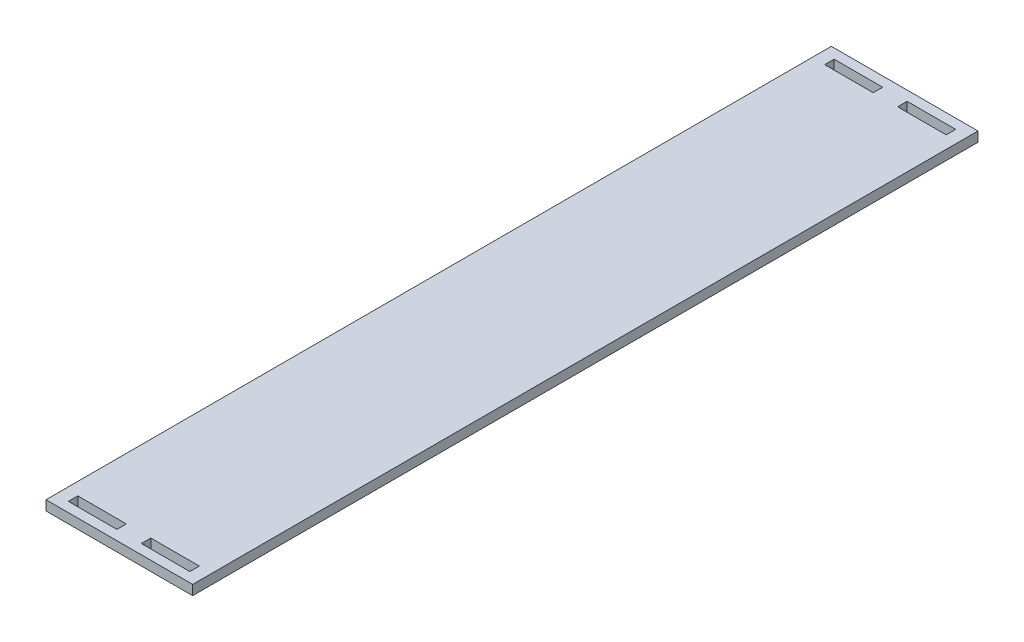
ISO-10303-21;
HEADER;
FILE_DESCRIPTION(('STEP AP214'),'2;1');
FILE_NAME('part.step','',(''),(''),'','','');
FILE_SCHEMA(('AUTOMOTIVE_DESIGN { 1 0 10303 214 1 1 1 1 }'));
ENDSEC;
DATA;
#1=APPLICATION_CONTEXT('core data for automotive mechanical design processes');
#2=APPLICATION_PROTOCOL_DEFINITION('international standard','automotive_design',2000,#1);
#3=PRODUCT_CONTEXT('',#1,'mechanical');
#4=PRODUCT('Part','Part','',(#3));
#5=PRODUCT_RELATED_PRODUCT_CATEGORY('part','',(#4));
#6=PRODUCT_DEFINITION_FORMATION('','',#4);
#7=PRODUCT_DEFINITION_CONTEXT('part definition',#1,'design');
#8=PRODUCT_DEFINITION('design','',#6,#7);
#9=PRODUCT_DEFINITION_SHAPE('','',#8);
#10=(LENGTH_UNIT() NAMED_UNIT(*) SI_UNIT(.MILLI.,.METRE.));
#11=(NAMED_UNIT(*) PLANE_ANGLE_UNIT() SI_UNIT($,.RADIAN.));
#12=(NAMED_UNIT(*) SI_UNIT($,.STERADIAN.) SOLID_ANGLE_UNIT());
#13=UNCERTAINTY_MEASURE_WITH_UNIT(LENGTH_MEASURE(1.E-05),#10,'distance_accuracy_value','');
#14=(GEOMETRIC_REPRESENTATION_CONTEXT(3) GLOBAL_UNCERTAINTY_ASSIGNED_CONTEXT((#13)) GLOBAL_UNIT_ASSIGNED_CONTEXT((#10,
#11,#12)) REPRESENTATION_CONTEXT('',''));
#15=CARTESIAN_POINT('',(0.,0.,0.));
#16=DIRECTION('',(0.,0.,1.));
#17=DIRECTION('',(1.,0.,0.));
#18=AXIS2_PLACEMENT_3D('',#15,#16,#17);
#19=CARTESIAN_POINT('',(0.,6.,0.));
#20=DIRECTION('',(0.,-1.,0.));
#21=DIRECTION('',(0.,0.,-1.));
#22=AXIS2_PLACEMENT_3D('',#19,#20,#21);
#23=PLANE('',#22);
#24=DIRECTION('',(-1.,0.,0.));
#25=VECTOR('',#24,1.);
#26=CARTESIAN_POINT('',(82.2999999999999,6.,-476.));
#27=LINE('',#26,#25);
#28=CARTESIAN_POINT('',(82.2999999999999,6.,-476.));
#29=VERTEX_POINT('',#28);
#30=CARTESIAN_POINT('',(52.5,6.,-476.));
#31=VERTEX_POINT('',#30);
#32=EDGE_CURVE('E206',#29,#31,#27,.T.);
#33=ORIENTED_EDGE('',*,*,#32,.F.);
#34=DIRECTION('',(0.,0.,-1.));
#35=VECTOR('',#34,1.);
#36=CARTESIAN_POINT('',(82.2999999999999,6.,-476.));
#37=LINE('',#36,#35);
#38=CARTESIAN_POINT('',(82.2999999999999,6.,-470.2));
#39=VERTEX_POINT('',#38);
#40=EDGE_CURVE('E214',#39,#29,#37,.T.);
#41=ORIENTED_EDGE('',*,*,#40,.F.);
#42=DIRECTION('',(1.,0.,0.));
#43=VECTOR('',#42,1.);
#44=CARTESIAN_POINT('',(82.2999999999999,6.,-470.2));
#45=LINE('',#44,#43);
#46=CARTESIAN_POINT('',(52.4999999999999,6.,-470.2));
#47=VERTEX_POINT('',#46);
#48=EDGE_CURVE('E211',#47,#39,#45,.T.);
#49=ORIENTED_EDGE('',*,*,#48,.F.);
#50=DIRECTION('',(0.,0.,1.));
#51=VECTOR('',#50,1.);
#52=CARTESIAN_POINT('',(52.5,6.,-476.));
#53=LINE('',#52,#51);
#54=EDGE_CURVE('E208',#31,#47,#53,.T.);
#55=ORIENTED_EDGE('',*,*,#54,.F.);
#56=EDGE_LOOP('',(#33,#41,#49,#55));
#57=FACE_BOUND('',#56,.T.);
#58=DIRECTION('',(0.,0.,-1.));
#59=VECTOR('',#58,1.);
#60=CARTESIAN_POINT('',(37.5,6.,-6.));
#61=LINE('',#60,#59);
#62=CARTESIAN_POINT('',(37.5,6.,-6.));
#63=VERTEX_POINT('',#62);
#64=CARTESIAN_POINT('',(37.5,6.,-11.8));
#65=VERTEX_POINT('',#64);
#66=EDGE_CURVE('E268',#63,#65,#61,.T.);
#67=ORIENTED_EDGE('',*,*,#66,.F.);
#68=DIRECTION('',(1.,0.,0.));
#69=VECTOR('',#68,1.);
#70=CARTESIAN_POINT('',(7.7,6.,-6.));
#71=LINE('',#70,#69);
#72=CARTESIAN_POINT('',(7.7,6.,-6.));
#73=VERTEX_POINT('',#72);
#74=EDGE_CURVE('E276',#73,#63,#71,.T.);
#75=ORIENTED_EDGE('',*,*,#74,.F.);
#76=DIRECTION('',(0.,0.,1.));
#77=VECTOR('',#76,1.);
#78=CARTESIAN_POINT('',(7.7,6.,-6.));
#79=LINE('',#78,#77);
#80=CARTESIAN_POINT('',(7.7,6.,-11.8));
#81=VERTEX_POINT('',#80);
#82=EDGE_CURVE('E273',#81,#73,#79,.T.);
#83=ORIENTED_EDGE('',*,*,#82,.F.);
#84=DIRECTION('',(-1.,0.,0.));
#85=VECTOR('',#84,1.);
#86=CARTESIAN_POINT('',(7.7,6.,-11.8));
#87=LINE('',#86,#85);
#88=EDGE_CURVE('E270',#65,#81,#87,.T.);
#89=ORIENTED_EDGE('',*,*,#88,.F.);
#90=EDGE_LOOP('',(#67,#75,#83,#89));
#91=FACE_BOUND('',#90,.T.);
#92=DIRECTION('',(0.,0.,1.));
#93=VECTOR('',#92,1.);
#94=CARTESIAN_POINT('',(0.,6.,0.));
#95=LINE('',#94,#93);
#96=CARTESIAN_POINT('',(0.,6.,-482.));
#97=VERTEX_POINT('',#96);
#98=CARTESIAN_POINT('',(0.,6.,0.));
#99=VERTEX_POINT('',#98);
#100=EDGE_CURVE('E299',#97,#99,#95,.T.);
#101=ORIENTED_EDGE('',*,*,#100,.T.);
#102=DIRECTION('',(1.,0.,0.));
#103=VECTOR('',#102,1.);
#104=CARTESIAN_POINT('',(0.,6.,0.));
#105=LINE('',#104,#103);
#106=CARTESIAN_POINT('',(90.,6.,0.));
#107=VERTEX_POINT('',#106);
#108=EDGE_CURVE('E302',#99,#107,#105,.T.);
#109=ORIENTED_EDGE('',*,*,#108,.T.);
#110=DIRECTION('',(0.,0.,-1.));
#111=VECTOR('',#110,1.);
#112=CARTESIAN_POINT('',(90.,6.,0.));
#113=LINE('',#112,#111);
#114=CARTESIAN_POINT('',(89.9999999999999,6.,-482.));
#115=VERTEX_POINT('',#114);
#116=EDGE_CURVE('E305',#107,#115,#113,.T.);
#117=ORIENTED_EDGE('',*,*,#116,.T.);
#118=DIRECTION('',(-1.,0.,0.));
#119=VECTOR('',#118,1.);
#120=CARTESIAN_POINT('',(0.,6.,-482.));
#121=LINE('',#120,#119);
#122=EDGE_CURVE('E307',#115,#97,#121,.T.);
#123=ORIENTED_EDGE('',*,*,#122,.T.);
#124=EDGE_LOOP('',(#101,#109,#117,#123));
#125=FACE_BOUND('',#124,.T.);
#126=DIRECTION('',(0.,0.,1.));
#127=VECTOR('',#126,1.);
#128=CARTESIAN_POINT('',(52.5,6.,-6.));
#129=LINE('',#128,#127);
#130=CARTESIAN_POINT('',(52.4999999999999,6.,-11.8));
#131=VERTEX_POINT('',#130);
#132=CARTESIAN_POINT('',(52.5,6.,-6.));
#133=VERTEX_POINT('',#132);
#134=EDGE_CURVE('E237',#131,#133,#129,.T.);
#135=ORIENTED_EDGE('',*,*,#134,.F.);
#136=DIRECTION('',(-1.,0.,0.));
#137=VECTOR('',#136,1.);
#138=CARTESIAN_POINT('',(82.2999999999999,6.,-11.8));
#139=LINE('',#138,#137);
#140=CARTESIAN_POINT('',(82.2999999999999,6.,-11.8));
#141=VERTEX_POINT('',#140);
#142=EDGE_CURVE('E245',#141,#131,#139,.T.);
#143=ORIENTED_EDGE('',*,*,#142,.F.);
#144=DIRECTION('',(0.,0.,-1.));
#145=VECTOR('',#144,1.);
#146=CARTESIAN_POINT('',(82.2999999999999,6.,-6.));
#147=LINE('',#146,#145);
#148=CARTESIAN_POINT('',(82.2999999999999,6.,-6.));
#149=VERTEX_POINT('',#148);
#150=EDGE_CURVE('E242',#149,#141,#147,.T.);
#151=ORIENTED_EDGE('',*,*,#150,.F.);
#152=DIRECTION('',(1.,0.,0.));
#153=VECTOR('',#152,1.);
#154=CARTESIAN_POINT('',(82.2999999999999,6.,-6.));
#155=LINE('',#154,#153);
#156=EDGE_CURVE('E239',#133,#149,#155,.T.);
#157=ORIENTED_EDGE('',*,*,#156,.F.);
#158=EDGE_LOOP('',(#135,#143,#151,#157));
#159=FACE_BOUND('',#158,.T.);
#160=DIRECTION('',(-1.,0.,0.));
#161=VECTOR('',#160,1.);
#162=CARTESIAN_POINT('',(7.7,6.,-476.));
#163=LINE('',#162,#161);
#164=CARTESIAN_POINT('',(37.5,6.,-476.));
#165=VERTEX_POINT('',#164);
#166=CARTESIAN_POINT('',(7.7,6.,-476.));
#167=VERTEX_POINT('',#166);
#168=EDGE_CURVE('E170',#165,#167,#163,.T.);
#169=ORIENTED_EDGE('',*,*,#168,.F.);
#170=DIRECTION('',(0.,0.,-1.));
#171=VECTOR('',#170,1.);
#172=CARTESIAN_POINT('',(37.5,6.,-476.));
#173=LINE('',#172,#171);
#174=CARTESIAN_POINT('',(37.5,6.,-470.2));
#175=VERTEX_POINT('',#174);
#176=EDGE_CURVE('E192',#175,#165,#173,.T.);
#177=ORIENTED_EDGE('',*,*,#176,.F.);
#178=DIRECTION('',(1.,0.,0.));
#179=VECTOR('',#178,1.);
#180=CARTESIAN_POINT('',(7.7,6.,-470.2));
#181=LINE('',#180,#179);
#182=CARTESIAN_POINT('',(7.7,6.,-470.2));
#183=VERTEX_POINT('',#182);
#184=EDGE_CURVE('E190',#183,#175,#181,.T.);
#185=ORIENTED_EDGE('',*,*,#184,.F.);
#186=DIRECTION('',(0.,0.,1.));
#187=VECTOR('',#186,1.);
#188=CARTESIAN_POINT('',(7.7,6.,-476.));
#189=LINE('',#188,#187);
#190=EDGE_CURVE('E178',#167,#183,#189,.T.);
#191=ORIENTED_EDGE('',*,*,#190,.F.);
#192=EDGE_LOOP('',(#169,#177,#185,#191));
#193=FACE_BOUND('',#192,.T.);
#194=ADVANCED_FACE('F33',(#57,#91,#125,#159,#193),#23,.F.);
#195=CARTESIAN_POINT('',(0.,0.,0.));
#196=DIRECTION('',(0.,-1.,0.));
#197=DIRECTION('',(0.,0.,-1.));
#198=AXIS2_PLACEMENT_3D('',#195,#196,#197);
#199=PLANE('',#198);
#200=DIRECTION('',(0.,0.,1.));
#201=VECTOR('',#200,1.);
#202=CARTESIAN_POINT('',(0.,0.,0.));
#203=LINE('',#202,#201);
#204=CARTESIAN_POINT('',(0.,0.,-482.));
#205=VERTEX_POINT('',#204);
#206=CARTESIAN_POINT('',(0.,0.,0.));
#207=VERTEX_POINT('',#206);
#208=EDGE_CURVE('E298',#205,#207,#203,.T.);
#209=ORIENTED_EDGE('',*,*,#208,.F.);
#210=DIRECTION('',(-1.,0.,0.));
#211=VECTOR('',#210,1.);
#212=CARTESIAN_POINT('',(0.,0.,-482.));
#213=LINE('',#212,#211);
#214=CARTESIAN_POINT('',(89.9999999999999,0.,-482.));
#215=VERTEX_POINT('',#214);
#216=EDGE_CURVE('E303',#215,#205,#213,.T.);
#217=ORIENTED_EDGE('',*,*,#216,.F.);
#218=DIRECTION('',(0.,0.,-1.));
#219=VECTOR('',#218,1.);
#220=CARTESIAN_POINT('',(90.,0.,0.));
#221=LINE('',#220,#219);
#222=CARTESIAN_POINT('',(90.,0.,0.));
#223=VERTEX_POINT('',#222);
#224=EDGE_CURVE('E314',#223,#215,#221,.T.);
#225=ORIENTED_EDGE('',*,*,#224,.F.);
#226=DIRECTION('',(1.,0.,0.));
#227=VECTOR('',#226,1.);
#228=CARTESIAN_POINT('',(0.,0.,0.));
#229=LINE('',#228,#227);
#230=EDGE_CURVE('E312',#207,#223,#229,.T.);
#231=ORIENTED_EDGE('',*,*,#230,.F.);
#232=EDGE_LOOP('',(#209,#217,#225,#231));
#233=FACE_BOUND('',#232,.T.);
#234=DIRECTION('',(1.,0.,0.));
#235=VECTOR('',#234,1.);
#236=CARTESIAN_POINT('',(7.7,0.,-6.));
#237=LINE('',#236,#235);
#238=CARTESIAN_POINT('',(7.7,0.,-6.));
#239=VERTEX_POINT('',#238);
#240=CARTESIAN_POINT('',(37.5,0.,-6.));
#241=VERTEX_POINT('',#240);
#242=EDGE_CURVE('E271',#239,#241,#237,.T.);
#243=ORIENTED_EDGE('',*,*,#242,.T.);
#244=DIRECTION('',(0.,0.,-1.));
#245=VECTOR('',#244,1.);
#246=CARTESIAN_POINT('',(37.5,0.,-6.));
#247=LINE('',#246,#245);
#248=CARTESIAN_POINT('',(37.5,0.,-11.8));
#249=VERTEX_POINT('',#248);
#250=EDGE_CURVE('E267',#241,#249,#247,.T.);
#251=ORIENTED_EDGE('',*,*,#250,.T.);
#252=DIRECTION('',(-1.,0.,0.));
#253=VECTOR('',#252,1.);
#254=CARTESIAN_POINT('',(7.7,0.,-11.8));
#255=LINE('',#254,#253);
#256=CARTESIAN_POINT('',(7.7,0.,-11.8));
#257=VERTEX_POINT('',#256);
#258=EDGE_CURVE('E281',#249,#257,#255,.T.);
#259=ORIENTED_EDGE('',*,*,#258,.T.);
#260=DIRECTION('',(0.,0.,1.));
#261=VECTOR('',#260,1.);
#262=CARTESIAN_POINT('',(7.7,0.,-6.));
#263=LINE('',#262,#261);
#264=EDGE_CURVE('E284',#257,#239,#263,.T.);
#265=ORIENTED_EDGE('',*,*,#264,.T.);
#266=EDGE_LOOP('',(#243,#251,#259,#265));
#267=FACE_BOUND('',#266,.T.);
#268=DIRECTION('',(-1.,0.,0.));
#269=VECTOR('',#268,1.);
#270=CARTESIAN_POINT('',(82.2999999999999,0.,-11.8));
#271=LINE('',#270,#269);
#272=CARTESIAN_POINT('',(82.2999999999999,0.,-11.8));
#273=VERTEX_POINT('',#272);
#274=CARTESIAN_POINT('',(52.4999999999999,0.,-11.8));
#275=VERTEX_POINT('',#274);
#276=EDGE_CURVE('E240',#273,#275,#271,.T.);
#277=ORIENTED_EDGE('',*,*,#276,.T.);
#278=DIRECTION('',(0.,0.,1.));
#279=VECTOR('',#278,1.);
#280=CARTESIAN_POINT('',(52.5,0.,-6.));
#281=LINE('',#280,#279);
#282=CARTESIAN_POINT('',(52.5,0.,-6.));
#283=VERTEX_POINT('',#282);
#284=EDGE_CURVE('E236',#275,#283,#281,.T.);
#285=ORIENTED_EDGE('',*,*,#284,.T.);
#286=DIRECTION('',(1.,0.,0.));
#287=VECTOR('',#286,1.);
#288=CARTESIAN_POINT('',(82.2999999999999,0.,-6.));
#289=LINE('',#288,#287);
#290=CARTESIAN_POINT('',(82.2999999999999,0.,-6.));
#291=VERTEX_POINT('',#290);
#292=EDGE_CURVE('E250',#283,#291,#289,.T.);
#293=ORIENTED_EDGE('',*,*,#292,.T.);
#294=DIRECTION('',(0.,0.,-1.));
#295=VECTOR('',#294,1.);
#296=CARTESIAN_POINT('',(82.2999999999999,0.,-6.));
#297=LINE('',#296,#295);
#298=EDGE_CURVE('E253',#291,#273,#297,.T.);
#299=ORIENTED_EDGE('',*,*,#298,.T.);
#300=EDGE_LOOP('',(#277,#285,#293,#299));
#301=FACE_BOUND('',#300,.T.);
#302=DIRECTION('',(0.,0.,-1.));
#303=VECTOR('',#302,1.);
#304=CARTESIAN_POINT('',(82.2999999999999,0.,-476.));
#305=LINE('',#304,#303);
#306=CARTESIAN_POINT('',(82.2999999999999,0.,-470.2));
#307=VERTEX_POINT('',#306);
#308=CARTESIAN_POINT('',(82.2999999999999,0.,-476.));
#309=VERTEX_POINT('',#308);
#310=EDGE_CURVE('E209',#307,#309,#305,.T.);
#311=ORIENTED_EDGE('',*,*,#310,.T.);
#312=DIRECTION('',(-1.,0.,0.));
#313=VECTOR('',#312,1.);
#314=CARTESIAN_POINT('',(82.2999999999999,0.,-476.));
#315=LINE('',#314,#313);
#316=CARTESIAN_POINT('',(52.5,0.,-476.));
#317=VERTEX_POINT('',#316);
#318=EDGE_CURVE('E186',#309,#317,#315,.T.);
#319=ORIENTED_EDGE('',*,*,#318,.T.);
#320=DIRECTION('',(0.,0.,1.));
#321=VECTOR('',#320,1.);
#322=CARTESIAN_POINT('',(52.5,0.,-476.));
#323=LINE('',#322,#321);
#324=CARTESIAN_POINT('',(52.4999999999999,0.,-470.2));
#325=VERTEX_POINT('',#324);
#326=EDGE_CURVE('E219',#317,#325,#323,.T.);
#327=ORIENTED_EDGE('',*,*,#326,.T.);
#328=DIRECTION('',(1.,0.,0.));
#329=VECTOR('',#328,1.);
#330=CARTESIAN_POINT('',(82.2999999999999,0.,-470.2));
#331=LINE('',#330,#329);
#332=EDGE_CURVE('E222',#325,#307,#331,.T.);
#333=ORIENTED_EDGE('',*,*,#332,.T.);
#334=EDGE_LOOP('',(#311,#319,#327,#333));
#335=FACE_BOUND('',#334,.T.);
#336=DIRECTION('',(0.,0.,-1.));
#337=VECTOR('',#336,1.);
#338=CARTESIAN_POINT('',(37.5,0.,-476.));
#339=LINE('',#338,#337);
#340=CARTESIAN_POINT('',(37.5,0.,-470.2));
#341=VERTEX_POINT('',#340);
#342=CARTESIAN_POINT('',(37.5,0.,-476.));
#343=VERTEX_POINT('',#342);
#344=EDGE_CURVE('E179',#341,#343,#339,.T.);
#345=ORIENTED_EDGE('',*,*,#344,.T.);
#346=DIRECTION('',(-1.,0.,0.));
#347=VECTOR('',#346,1.);
#348=CARTESIAN_POINT('',(7.7,0.,-476.));
#349=LINE('',#348,#347);
#350=CARTESIAN_POINT('',(7.7,0.,-476.));
#351=VERTEX_POINT('',#350);
#352=EDGE_CURVE('E56',#343,#351,#349,.T.);
#353=ORIENTED_EDGE('',*,*,#352,.T.);
#354=DIRECTION('',(0.,0.,1.));
#355=VECTOR('',#354,1.);
#356=CARTESIAN_POINT('',(7.7,0.,-476.));
#357=LINE('',#356,#355);
#358=CARTESIAN_POINT('',(7.7,0.,-470.2));
#359=VERTEX_POINT('',#358);
#360=EDGE_CURVE('E185',#351,#359,#357,.T.);
#361=ORIENTED_EDGE('',*,*,#360,.T.);
#362=DIRECTION('',(1.,0.,0.));
#363=VECTOR('',#362,1.);
#364=CARTESIAN_POINT('',(7.7,0.,-470.2));
#365=LINE('',#364,#363);
#366=EDGE_CURVE('E198',#359,#341,#365,.T.);
#367=ORIENTED_EDGE('',*,*,#366,.T.);
#368=EDGE_LOOP('',(#345,#353,#361,#367));
#369=FACE_BOUND('',#368,.T.);
#370=ADVANCED_FACE('F332',(#233,#267,#301,#335,#369),#199,.T.);
#371=CARTESIAN_POINT('',(0.,6.,0.));
#372=DIRECTION('',(1.,0.,0.));
#373=DIRECTION('',(0.,0.,-1.));
#374=AXIS2_PLACEMENT_3D('',#371,#372,#373);
#375=PLANE('',#374);
#376=ORIENTED_EDGE('',*,*,#208,.T.);
#377=DIRECTION('',(0.,-1.,0.));
#378=VECTOR('',#377,1.);
#379=CARTESIAN_POINT('',(0.,6.,0.));
#380=LINE('',#379,#378);
#381=EDGE_CURVE('E11',#99,#207,#380,.T.);
#382=ORIENTED_EDGE('',*,*,#381,.F.);
#383=ORIENTED_EDGE('',*,*,#100,.F.);
#384=DIRECTION('',(0.,-1.,0.));
#385=VECTOR('',#384,1.);
#386=CARTESIAN_POINT('',(0.,6.,-482.));
#387=LINE('',#386,#385);
#388=EDGE_CURVE('E309',#97,#205,#387,.T.);
#389=ORIENTED_EDGE('',*,*,#388,.T.);
#390=EDGE_LOOP('',(#376,#382,#383,#389));
#391=FACE_BOUND('',#390,.T.);
#392=ADVANCED_FACE('F35',(#391),#375,.F.);
#393=CARTESIAN_POINT('',(0.,6.,0.));
#394=DIRECTION('',(0.,0.,-1.));
#395=DIRECTION('',(-1.,0.,0.));
#396=AXIS2_PLACEMENT_3D('',#393,#394,#395);
#397=PLANE('',#396);
#398=ORIENTED_EDGE('',*,*,#230,.T.);
#399=DIRECTION('',(0.,-1.,0.));
#400=VECTOR('',#399,1.);
#401=CARTESIAN_POINT('',(90.,6.,0.));
#402=LINE('',#401,#400);
#403=EDGE_CURVE('E41',#107,#223,#402,.T.);
#404=ORIENTED_EDGE('',*,*,#403,.F.);
#405=ORIENTED_EDGE('',*,*,#108,.F.);
#406=ORIENTED_EDGE('',*,*,#381,.T.);
#407=EDGE_LOOP('',(#398,#404,#405,#406));
#408=FACE_BOUND('',#407,.T.);
#409=ADVANCED_FACE('F343',(#408),#397,.F.);
#410=CARTESIAN_POINT('',(90.,6.,0.));
#411=DIRECTION('',(-1.,0.,0.));
#412=DIRECTION('',(0.,0.,1.));
#413=AXIS2_PLACEMENT_3D('',#410,#411,#412);
#414=PLANE('',#413);
#415=ORIENTED_EDGE('',*,*,#224,.T.);
#416=DIRECTION('',(0.,-1.,0.));
#417=VECTOR('',#416,1.);
#418=CARTESIAN_POINT('',(89.9999999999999,6.,-482.));
#419=LINE('',#418,#417);
#420=EDGE_CURVE('E319',#115,#215,#419,.T.);
#421=ORIENTED_EDGE('',*,*,#420,.F.);
#422=ORIENTED_EDGE('',*,*,#116,.F.);
#423=ORIENTED_EDGE('',*,*,#403,.T.);
#424=EDGE_LOOP('',(#415,#421,#422,#423));
#425=FACE_BOUND('',#424,.T.);
#426=ADVANCED_FACE('F326',(#425),#414,.F.);
#427=CARTESIAN_POINT('',(0.,6.,-482.));
#428=DIRECTION('',(0.,0.,1.));
#429=DIRECTION('',(1.,0.,0.));
#430=AXIS2_PLACEMENT_3D('',#427,#428,#429);
#431=PLANE('',#430);
#432=ORIENTED_EDGE('',*,*,#216,.T.);
#433=ORIENTED_EDGE('',*,*,#388,.F.);
#434=ORIENTED_EDGE('',*,*,#122,.F.);
#435=ORIENTED_EDGE('',*,*,#420,.T.);
#436=EDGE_LOOP('',(#432,#433,#434,#435));
#437=FACE_BOUND('',#436,.T.);
#438=ADVANCED_FACE('F336',(#437),#431,.F.);
#439=CARTESIAN_POINT('',(37.5,6.,-6.));
#440=DIRECTION('',(-1.,0.,0.));
#441=DIRECTION('',(0.,0.,1.));
#442=AXIS2_PLACEMENT_3D('',#439,#440,#441);
#443=PLANE('',#442);
#444=ORIENTED_EDGE('',*,*,#250,.F.);
#445=DIRECTION('',(0.,-1.,0.));
#446=VECTOR('',#445,1.);
#447=CARTESIAN_POINT('',(37.5,6.,-6.));
#448=LINE('',#447,#446);
#449=EDGE_CURVE('E278',#63,#241,#448,.T.);
#450=ORIENTED_EDGE('',*,*,#449,.F.);
#451=ORIENTED_EDGE('',*,*,#66,.T.);
#452=DIRECTION('',(0.,-1.,0.));
#453=VECTOR('',#452,1.);
#454=CARTESIAN_POINT('',(37.5,6.,-11.8));
#455=LINE('',#454,#453);
#456=EDGE_CURVE('E295',#65,#249,#455,.T.);
#457=ORIENTED_EDGE('',*,*,#456,.T.);
#458=EDGE_LOOP('',(#444,#450,#451,#457));
#459=FACE_BOUND('',#458,.T.);
#460=ADVANCED_FACE('F360',(#459),#443,.T.);
#461=CARTESIAN_POINT('',(7.7,6.,-11.8));
#462=DIRECTION('',(0.,0.,1.));
#463=DIRECTION('',(1.,0.,0.));
#464=AXIS2_PLACEMENT_3D('',#461,#462,#463);
#465=PLANE('',#464);
#466=ORIENTED_EDGE('',*,*,#258,.F.);
#467=ORIENTED_EDGE('',*,*,#456,.F.);
#468=ORIENTED_EDGE('',*,*,#88,.T.);
#469=DIRECTION('',(0.,-1.,0.));
#470=VECTOR('',#469,1.);
#471=CARTESIAN_POINT('',(7.7,6.,-11.8));
#472=LINE('',#471,#470);
#473=EDGE_CURVE('E293',#81,#257,#472,.T.);
#474=ORIENTED_EDGE('',*,*,#473,.T.);
#475=EDGE_LOOP('',(#466,#467,#468,#474));
#476=FACE_BOUND('',#475,.T.);
#477=ADVANCED_FACE('F367',(#476),#465,.T.);
#478=CARTESIAN_POINT('',(7.7,6.,-6.));
#479=DIRECTION('',(1.,0.,0.));
#480=DIRECTION('',(0.,0.,-1.));
#481=AXIS2_PLACEMENT_3D('',#478,#479,#480);
#482=PLANE('',#481);
#483=ORIENTED_EDGE('',*,*,#264,.F.);
#484=ORIENTED_EDGE('',*,*,#473,.F.);
#485=ORIENTED_EDGE('',*,*,#82,.T.);
#486=DIRECTION('',(0.,-1.,0.));
#487=VECTOR('',#486,1.);
#488=CARTESIAN_POINT('',(7.7,6.,-6.));
#489=LINE('',#488,#487);
#490=EDGE_CURVE('E291',#73,#239,#489,.T.);
#491=ORIENTED_EDGE('',*,*,#490,.T.);
#492=EDGE_LOOP('',(#483,#484,#485,#491));
#493=FACE_BOUND('',#492,.T.);
#494=ADVANCED_FACE('F372',(#493),#482,.T.);
#495=CARTESIAN_POINT('',(7.7,6.,-6.));
#496=DIRECTION('',(0.,0.,-1.));
#497=DIRECTION('',(-1.,0.,0.));
#498=AXIS2_PLACEMENT_3D('',#495,#496,#497);
#499=PLANE('',#498);
#500=ORIENTED_EDGE('',*,*,#242,.F.);
#501=ORIENTED_EDGE('',*,*,#490,.F.);
#502=ORIENTED_EDGE('',*,*,#74,.T.);
#503=ORIENTED_EDGE('',*,*,#449,.T.);
#504=EDGE_LOOP('',(#500,#501,#502,#503));
#505=FACE_BOUND('',#504,.T.);
#506=ADVANCED_FACE('F379',(#505),#499,.T.);
#507=CARTESIAN_POINT('',(52.5,6.,-6.));
#508=DIRECTION('',(1.,0.,0.));
#509=DIRECTION('',(0.,0.,-1.));
#510=AXIS2_PLACEMENT_3D('',#507,#508,#509);
#511=PLANE('',#510);
#512=ORIENTED_EDGE('',*,*,#284,.F.);
#513=DIRECTION('',(0.,-1.,0.));
#514=VECTOR('',#513,1.);
#515=CARTESIAN_POINT('',(52.4999999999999,6.,-11.8));
#516=LINE('',#515,#514);
#517=EDGE_CURVE('E247',#131,#275,#516,.T.);
#518=ORIENTED_EDGE('',*,*,#517,.F.);
#519=ORIENTED_EDGE('',*,*,#134,.T.);
#520=DIRECTION('',(0.,-1.,0.));
#521=VECTOR('',#520,1.);
#522=CARTESIAN_POINT('',(52.5,6.,-6.));
#523=LINE('',#522,#521);
#524=EDGE_CURVE('E264',#133,#283,#523,.T.);
#525=ORIENTED_EDGE('',*,*,#524,.T.);
#526=EDGE_LOOP('',(#512,#518,#519,#525));
#527=FACE_BOUND('',#526,.T.);
#528=ADVANCED_FACE('F392',(#527),#511,.T.);
#529=CARTESIAN_POINT('',(82.2999999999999,6.,-6.));
#530=DIRECTION('',(0.,0.,-1.));
#531=DIRECTION('',(-1.,0.,0.));
#532=AXIS2_PLACEMENT_3D('',#529,#530,#531);
#533=PLANE('',#532);
#534=ORIENTED_EDGE('',*,*,#292,.F.);
#535=ORIENTED_EDGE('',*,*,#524,.F.);
#536=ORIENTED_EDGE('',*,*,#156,.T.);
#537=DIRECTION('',(0.,-1.,0.));
#538=VECTOR('',#537,1.);
#539=CARTESIAN_POINT('',(82.2999999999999,6.,-6.));
#540=LINE('',#539,#538);
#541=EDGE_CURVE('E262',#149,#291,#540,.T.);
#542=ORIENTED_EDGE('',*,*,#541,.T.);
#543=EDGE_LOOP('',(#534,#535,#536,#542));
#544=FACE_BOUND('',#543,.T.);
#545=ADVANCED_FACE('F397',(#544),#533,.T.);
#546=CARTESIAN_POINT('',(82.2999999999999,6.,-6.));
#547=DIRECTION('',(-1.,0.,0.));
#548=DIRECTION('',(0.,0.,1.));
#549=AXIS2_PLACEMENT_3D('',#546,#547,#548);
#550=PLANE('',#549);
#551=ORIENTED_EDGE('',*,*,#298,.F.);
#552=ORIENTED_EDGE('',*,*,#541,.F.);
#553=ORIENTED_EDGE('',*,*,#150,.T.);
#554=DIRECTION('',(0.,-1.,0.));
#555=VECTOR('',#554,1.);
#556=CARTESIAN_POINT('',(82.2999999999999,6.,-11.8));
#557=LINE('',#556,#555);
#558=EDGE_CURVE('E260',#141,#273,#557,.T.);
#559=ORIENTED_EDGE('',*,*,#558,.T.);
#560=EDGE_LOOP('',(#551,#552,#553,#559));
#561=FACE_BOUND('',#560,.T.);
#562=ADVANCED_FACE('F401',(#561),#550,.T.);
#563=CARTESIAN_POINT('',(82.2999999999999,6.,-11.8));
#564=DIRECTION('',(0.,0.,1.));
#565=DIRECTION('',(1.,0.,0.));
#566=AXIS2_PLACEMENT_3D('',#563,#564,#565);
#567=PLANE('',#566);
#568=ORIENTED_EDGE('',*,*,#276,.F.);
#569=ORIENTED_EDGE('',*,*,#558,.F.);
#570=ORIENTED_EDGE('',*,*,#142,.T.);
#571=ORIENTED_EDGE('',*,*,#517,.T.);
#572=EDGE_LOOP('',(#568,#569,#570,#571));
#573=FACE_BOUND('',#572,.T.);
#574=ADVANCED_FACE('F405',(#573),#567,.T.);
#575=CARTESIAN_POINT('',(82.2999999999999,6.,-476.));
#576=DIRECTION('',(0.,0.,1.));
#577=DIRECTION('',(1.,0.,0.));
#578=AXIS2_PLACEMENT_3D('',#575,#576,#577);
#579=PLANE('',#578);
#580=ORIENTED_EDGE('',*,*,#318,.F.);
#581=DIRECTION('',(0.,-1.,0.));
#582=VECTOR('',#581,1.);
#583=CARTESIAN_POINT('',(82.2999999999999,6.,-476.));
#584=LINE('',#583,#582);
#585=EDGE_CURVE('E216',#29,#309,#584,.T.);
#586=ORIENTED_EDGE('',*,*,#585,.F.);
#587=ORIENTED_EDGE('',*,*,#32,.T.);
#588=DIRECTION('',(0.,-1.,0.));
#589=VECTOR('',#588,1.);
#590=CARTESIAN_POINT('',(52.5,6.,-476.));
#591=LINE('',#590,#589);
#592=EDGE_CURVE('E233',#31,#317,#591,.T.);
#593=ORIENTED_EDGE('',*,*,#592,.T.);
#594=EDGE_LOOP('',(#580,#586,#587,#593));
#595=FACE_BOUND('',#594,.T.);
#596=ADVANCED_FACE('F409',(#595),#579,.T.);
#597=CARTESIAN_POINT('',(52.5,6.,-476.));
#598=DIRECTION('',(1.,0.,0.));
#599=DIRECTION('',(0.,0.,-1.));
#600=AXIS2_PLACEMENT_3D('',#597,#598,#599);
#601=PLANE('',#600);
#602=ORIENTED_EDGE('',*,*,#326,.F.);
#603=ORIENTED_EDGE('',*,*,#592,.F.);
#604=ORIENTED_EDGE('',*,*,#54,.T.);
#605=DIRECTION('',(0.,-1.,0.));
#606=VECTOR('',#605,1.);
#607=CARTESIAN_POINT('',(52.4999999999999,6.,-470.2));
#608=LINE('',#607,#606);
#609=EDGE_CURVE('E231',#47,#325,#608,.T.);
#610=ORIENTED_EDGE('',*,*,#609,.T.);
#611=EDGE_LOOP('',(#602,#603,#604,#610));
#612=FACE_BOUND('',#611,.T.);
#613=ADVANCED_FACE('F413',(#612),#601,.T.);
#614=CARTESIAN_POINT('',(82.2999999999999,6.,-470.2));
#615=DIRECTION('',(0.,0.,-1.));
#616=DIRECTION('',(-1.,0.,0.));
#617=AXIS2_PLACEMENT_3D('',#614,#615,#616);
#618=PLANE('',#617);
#619=ORIENTED_EDGE('',*,*,#332,.F.);
#620=ORIENTED_EDGE('',*,*,#609,.F.);
#621=ORIENTED_EDGE('',*,*,#48,.T.);
#622=DIRECTION('',(0.,-1.,0.));
#623=VECTOR('',#622,1.);
#624=CARTESIAN_POINT('',(82.2999999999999,6.,-470.2));
#625=LINE('',#624,#623);
#626=EDGE_CURVE('E229',#39,#307,#625,.T.);
#627=ORIENTED_EDGE('',*,*,#626,.T.);
#628=EDGE_LOOP('',(#619,#620,#621,#627));
#629=FACE_BOUND('',#628,.T.);
#630=ADVANCED_FACE('F417',(#629),#618,.T.);
#631=CARTESIAN_POINT('',(82.2999999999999,6.,-476.));
#632=DIRECTION('',(-1.,0.,0.));
#633=DIRECTION('',(0.,0.,1.));
#634=AXIS2_PLACEMENT_3D('',#631,#632,#633);
#635=PLANE('',#634);
#636=ORIENTED_EDGE('',*,*,#310,.F.);
#637=ORIENTED_EDGE('',*,*,#626,.F.);
#638=ORIENTED_EDGE('',*,*,#40,.T.);
#639=ORIENTED_EDGE('',*,*,#585,.T.);
#640=EDGE_LOOP('',(#636,#637,#638,#639));
#641=FACE_BOUND('',#640,.T.);
#642=ADVANCED_FACE('F421',(#641),#635,.T.);
#643=CARTESIAN_POINT('',(7.7,6.,-476.));
#644=DIRECTION('',(0.,0.,1.));
#645=DIRECTION('',(1.,0.,0.));
#646=AXIS2_PLACEMENT_3D('',#643,#644,#645);
#647=PLANE('',#646);
#648=ORIENTED_EDGE('',*,*,#352,.F.);
#649=DIRECTION('',(0.,-1.,0.));
#650=VECTOR('',#649,1.);
#651=CARTESIAN_POINT('',(37.5,6.,-476.));
#652=LINE('',#651,#650);
#653=EDGE_CURVE('E174',#165,#343,#652,.T.);
#654=ORIENTED_EDGE('',*,*,#653,.F.);
#655=ORIENTED_EDGE('',*,*,#168,.T.);
#656=DIRECTION('',(0.,-1.,0.));
#657=VECTOR('',#656,1.);
#658=CARTESIAN_POINT('',(7.7,6.,-476.));
#659=LINE('',#658,#657);
#660=EDGE_CURVE('E173',#167,#351,#659,.T.);
#661=ORIENTED_EDGE('',*,*,#660,.T.);
#662=EDGE_LOOP('',(#648,#654,#655,#661));
#663=FACE_BOUND('',#662,.T.);
#664=ADVANCED_FACE('F172',(#663),#647,.T.);
#665=CARTESIAN_POINT('',(7.7,6.,-476.));
#666=DIRECTION('',(1.,0.,0.));
#667=DIRECTION('',(0.,0.,-1.));
#668=AXIS2_PLACEMENT_3D('',#665,#666,#667);
#669=PLANE('',#668);
#670=ORIENTED_EDGE('',*,*,#360,.F.);
#671=ORIENTED_EDGE('',*,*,#660,.F.);
#672=ORIENTED_EDGE('',*,*,#190,.T.);
#673=DIRECTION('',(0.,-1.,0.));
#674=VECTOR('',#673,1.);
#675=CARTESIAN_POINT('',(7.7,6.,-470.2));
#676=LINE('',#675,#674);
#677=EDGE_CURVE('E187',#183,#359,#676,.T.);
#678=ORIENTED_EDGE('',*,*,#677,.T.);
#679=EDGE_LOOP('',(#670,#671,#672,#678));
#680=FACE_BOUND('',#679,.T.);
#681=ADVANCED_FACE('F182',(#680),#669,.T.);
#682=CARTESIAN_POINT('',(7.7,6.,-470.2));
#683=DIRECTION('',(0.,0.,-1.));
#684=DIRECTION('',(-1.,0.,0.));
#685=AXIS2_PLACEMENT_3D('',#682,#683,#684);
#686=PLANE('',#685);
#687=ORIENTED_EDGE('',*,*,#366,.F.);
#688=ORIENTED_EDGE('',*,*,#677,.F.);
#689=ORIENTED_EDGE('',*,*,#184,.T.);
#690=DIRECTION('',(0.,-1.,0.));
#691=VECTOR('',#690,1.);
#692=CARTESIAN_POINT('',(37.5,6.,-470.2));
#693=LINE('',#692,#691);
#694=EDGE_CURVE('E48',#175,#341,#693,.T.);
#695=ORIENTED_EDGE('',*,*,#694,.T.);
#696=EDGE_LOOP('',(#687,#688,#689,#695));
#697=FACE_BOUND('',#696,.T.);
#698=ADVANCED_FACE('F430',(#697),#686,.T.);
#699=CARTESIAN_POINT('',(37.5,6.,-476.));
#700=DIRECTION('',(-1.,0.,0.));
#701=DIRECTION('',(0.,0.,1.));
#702=AXIS2_PLACEMENT_3D('',#699,#700,#701);
#703=PLANE('',#702);
#704=ORIENTED_EDGE('',*,*,#344,.F.);
#705=ORIENTED_EDGE('',*,*,#694,.F.);
#706=ORIENTED_EDGE('',*,*,#176,.T.);
#707=ORIENTED_EDGE('',*,*,#653,.T.);
#708=EDGE_LOOP('',(#704,#705,#706,#707));
#709=FACE_BOUND('',#708,.T.);
#710=ADVANCED_FACE('F433',(#709),#703,.T.);
#711=CLOSED_SHELL('',(#194,#370,#392,#409,#426,#438,#460,#477,#494,#506,#528,#545,#562,#574,
#596,#613,#630,#642,#664,#681,#698,#710));
#712=MANIFOLD_SOLID_BREP('B2',#711);
#713=ADVANCED_BREP_SHAPE_REPRESENTATION('',(#18,#712),#14);
#714=SHAPE_DEFINITION_REPRESENTATION(#9,#713);
ENDSEC;
END-ISO-10303-21;
